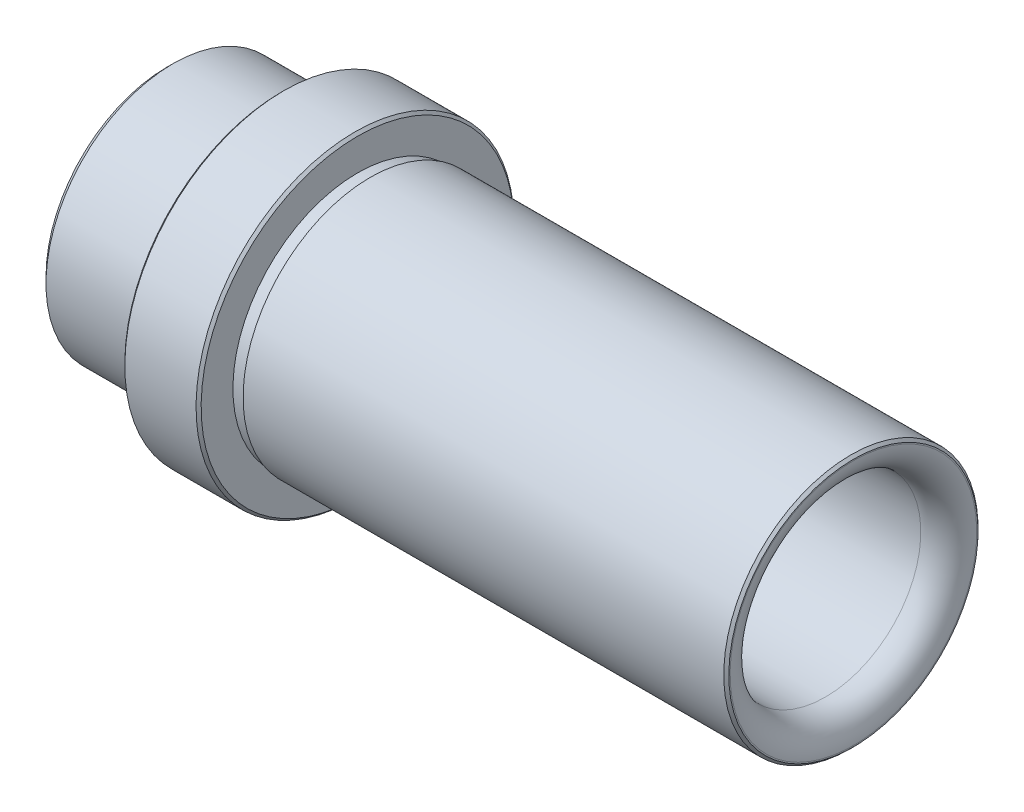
ISO-10303-21;
HEADER;
FILE_DESCRIPTION(('STEP AP214'),'2;1');
FILE_NAME('part.step','',(''),(''),'','','');
FILE_SCHEMA(('AUTOMOTIVE_DESIGN { 1 0 10303 214 1 1 1 1 }'));
ENDSEC;
DATA;
#1=APPLICATION_CONTEXT('core data for automotive mechanical design processes');
#2=APPLICATION_PROTOCOL_DEFINITION('international standard','automotive_design',2000,#1);
#3=PRODUCT_CONTEXT('',#1,'mechanical');
#4=PRODUCT('Part','Part','',(#3));
#5=PRODUCT_RELATED_PRODUCT_CATEGORY('part','',(#4));
#6=PRODUCT_DEFINITION_FORMATION('','',#4);
#7=PRODUCT_DEFINITION_CONTEXT('part definition',#1,'design');
#8=PRODUCT_DEFINITION('design','',#6,#7);
#9=PRODUCT_DEFINITION_SHAPE('','',#8);
#10=(LENGTH_UNIT() NAMED_UNIT(*) SI_UNIT(.MILLI.,.METRE.));
#11=(NAMED_UNIT(*) PLANE_ANGLE_UNIT() SI_UNIT($,.RADIAN.));
#12=(NAMED_UNIT(*) SI_UNIT($,.STERADIAN.) SOLID_ANGLE_UNIT());
#13=UNCERTAINTY_MEASURE_WITH_UNIT(LENGTH_MEASURE(1.E-05),#10,'distance_accuracy_value','');
#14=(GEOMETRIC_REPRESENTATION_CONTEXT(3) GLOBAL_UNCERTAINTY_ASSIGNED_CONTEXT((#13)) GLOBAL_UNIT_ASSIGNED_CONTEXT((#10,
#11,#12)) REPRESENTATION_CONTEXT('',''));
#15=CARTESIAN_POINT('',(0.,0.,0.));
#16=DIRECTION('',(0.,0.,1.));
#17=DIRECTION('',(1.,0.,0.));
#18=AXIS2_PLACEMENT_3D('',#15,#16,#17);
#19=CARTESIAN_POINT('',(-2.89999999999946,-60.0000000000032,-78.0000000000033));
#20=DIRECTION('',(1.,0.,0.));
#21=DIRECTION('',(0.,0.,-1.));
#22=AXIS2_PLACEMENT_3D('',#19,#20,#21);
#23=TOROIDAL_SURFACE('',#22,9.70000000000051,2.2);
#24=CARTESIAN_POINT('',(-0.699999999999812,-60.0000000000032,-78.0000000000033));
#25=DIRECTION('',(1.,0.,0.));
#26=DIRECTION('',(0.,1.00000000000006,0.));
#27=AXIS2_PLACEMENT_3D('',#24,#25,#26);
#28=CIRCLE('',#27,9.7);
#29=CARTESIAN_POINT('',(-0.699999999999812,-50.3000000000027,-78.0000000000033));
#30=VERTEX_POINT('',#29);
#31=EDGE_CURVE('E8',#30,#30,#28,.T.);
#32=ORIENTED_EDGE('',*,*,#31,.T.);
#33=EDGE_LOOP('',(#32));
#34=FACE_BOUND('',#33,.T.);
#35=CARTESIAN_POINT('',(-2.89999999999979,-60.0000000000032,-78.0000000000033));
#36=DIRECTION('',(1.,0.,0.));
#37=DIRECTION('',(0.,1.00000000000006,0.));
#38=AXIS2_PLACEMENT_3D('',#35,#36,#37);
#39=CIRCLE('',#38,7.5);
#40=CARTESIAN_POINT('',(-2.89999999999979,-52.5000000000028,-78.0000000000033));
#41=VERTEX_POINT('',#40);
#42=EDGE_CURVE('E67',#41,#41,#39,.T.);
#43=ORIENTED_EDGE('',*,*,#42,.F.);
#44=EDGE_LOOP('',(#43));
#45=FACE_BOUND('',#44,.T.);
#46=ADVANCED_FACE('F12',(#34,#45),#23,.T.);
#47=CARTESIAN_POINT('',(-0.699999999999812,-50.2500000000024,-78.0000000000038));
#48=DIRECTION('',(1.,0.,0.));
#49=DIRECTION('',(0.,1.00000000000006,0.));
#50=AXIS2_PLACEMENT_3D('',#47,#48,#49);
#51=PLANE('',#50);
#52=CARTESIAN_POINT('',(-0.699999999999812,-60.0000000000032,-78.0000000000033));
#53=DIRECTION('',(1.,0.,0.));
#54=DIRECTION('',(0.,1.00000000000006,0.));
#55=AXIS2_PLACEMENT_3D('',#52,#53,#54);
#56=CIRCLE('',#55,9.8);
#57=CARTESIAN_POINT('',(-0.699999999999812,-50.2000000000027,-78.0000000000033));
#58=VERTEX_POINT('',#57);
#59=EDGE_CURVE('E21',#58,#58,#56,.T.);
#60=ORIENTED_EDGE('',*,*,#59,.T.);
#61=EDGE_LOOP('',(#60));
#62=FACE_BOUND('',#61,.T.);
#63=ORIENTED_EDGE('',*,*,#31,.F.);
#64=EDGE_LOOP('',(#63));
#65=FACE_BOUND('',#64,.T.);
#66=ADVANCED_FACE('F82',(#62,#65),#51,.T.);
#67=DIRECTION('',(0.707106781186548,-0.707106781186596,0.));
#68=VECTOR('',#67,1.);
#69=CARTESIAN_POINT('',(-0.799999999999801,-50.1000000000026,-78.000000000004));
#70=LINE('',#69,#68);
#71=CARTESIAN_POINT('',(9.10000000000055,-60.0000000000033,-78.0000000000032));
#72=DIRECTION('',(-1.,0.,0.));
#73=AXIS1_PLACEMENT('',#71,#72);
#74=SURFACE_OF_REVOLUTION('',#70,#73);
#75=CARTESIAN_POINT('',(-0.89999999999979,-60.0000000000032,-78.0000000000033));
#76=DIRECTION('',(1.,0.,0.));
#77=DIRECTION('',(0.,1.00000000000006,0.));
#78=AXIS2_PLACEMENT_3D('',#75,#76,#77);
#79=CIRCLE('',#78,10.);
#80=CARTESIAN_POINT('',(-0.89999999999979,-50.0000000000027,-78.0000000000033));
#81=VERTEX_POINT('',#80);
#82=EDGE_CURVE('E41',#81,#81,#79,.T.);
#83=ORIENTED_EDGE('',*,*,#82,.T.);
#84=EDGE_LOOP('',(#83));
#85=FACE_BOUND('',#84,.T.);
#86=ORIENTED_EDGE('',*,*,#59,.F.);
#87=EDGE_LOOP('',(#86));
#88=FACE_BOUND('',#87,.T.);
#89=ADVANCED_FACE('F85',(#85,#88),#74,.F.);
#90=CARTESIAN_POINT('',(-19.7999999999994,-60.0000000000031,-78.0000000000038));
#91=DIRECTION('',(-1.,0.,0.));
#92=DIRECTION('',(0.,0.,1.00000000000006));
#93=AXIS2_PLACEMENT_3D('',#90,#91,#92);
#94=CYLINDRICAL_SURFACE('',#93,10.);
#95=CARTESIAN_POINT('',(-38.6999999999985,-60.0000000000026,-78.000000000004));
#96=DIRECTION('',(1.,0.,0.));
#97=DIRECTION('',(0.,1.00000000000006,0.));
#98=AXIS2_PLACEMENT_3D('',#95,#96,#97);
#99=CIRCLE('',#98,10.);
#100=CARTESIAN_POINT('',(-38.6999999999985,-50.000000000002,-78.000000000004));
#101=VERTEX_POINT('',#100);
#102=EDGE_CURVE('E30',#101,#101,#99,.T.);
#103=ORIENTED_EDGE('',*,*,#102,.T.);
#104=EDGE_LOOP('',(#103));
#105=FACE_BOUND('',#104,.T.);
#106=ORIENTED_EDGE('',*,*,#82,.F.);
#107=EDGE_LOOP('',(#106));
#108=FACE_BOUND('',#107,.T.);
#109=ADVANCED_FACE('F89',(#105,#108),#94,.T.);
#110=CARTESIAN_POINT('',(-38.6999999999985,-50.1000000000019,-78.0000000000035));
#111=DIRECTION('',(-1.,0.,0.));
#112=DIRECTION('',(0.,0.,1.00000000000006));
#113=AXIS2_PLACEMENT_3D('',#110,#111,#112);
#114=PLANE('',#113);
#115=CARTESIAN_POINT('',(-38.6999999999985,-60.0000000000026,-78.000000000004));
#116=DIRECTION('',(1.,0.,0.));
#117=DIRECTION('',(0.,1.00000000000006,0.));
#118=AXIS2_PLACEMENT_3D('',#115,#116,#117);
#119=CIRCLE('',#118,9.8);
#120=CARTESIAN_POINT('',(-38.6999999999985,-50.2000000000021,-78.000000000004));
#121=VERTEX_POINT('',#120);
#122=EDGE_CURVE('E49',#121,#121,#119,.T.);
#123=ORIENTED_EDGE('',*,*,#122,.T.);
#124=EDGE_LOOP('',(#123));
#125=FACE_BOUND('',#124,.T.);
#126=ORIENTED_EDGE('',*,*,#102,.F.);
#127=EDGE_LOOP('',(#126));
#128=FACE_BOUND('',#127,.T.);
#129=ADVANCED_FACE('F93',(#125,#128),#114,.T.);
#130=CARTESIAN_POINT('',(-39.1999999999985,-60.0000000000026,-78.000000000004));
#131=DIRECTION('',(-1.,0.,0.));
#132=DIRECTION('',(0.,0.,1.00000000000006));
#133=AXIS2_PLACEMENT_3D('',#130,#131,#132);
#134=CYLINDRICAL_SURFACE('',#133,9.8);
#135=CARTESIAN_POINT('',(-39.6999999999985,-60.0000000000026,-78.000000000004));
#136=DIRECTION('',(1.,0.,0.));
#137=DIRECTION('',(0.,1.00000000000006,0.));
#138=AXIS2_PLACEMENT_3D('',#135,#136,#137);
#139=CIRCLE('',#138,9.8);
#140=CARTESIAN_POINT('',(-39.6999999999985,-50.2000000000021,-78.000000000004));
#141=VERTEX_POINT('',#140);
#142=EDGE_CURVE('E45',#141,#141,#139,.T.);
#143=ORIENTED_EDGE('',*,*,#142,.T.);
#144=EDGE_LOOP('',(#143));
#145=FACE_BOUND('',#144,.T.);
#146=ORIENTED_EDGE('',*,*,#122,.F.);
#147=EDGE_LOOP('',(#146));
#148=FACE_BOUND('',#147,.T.);
#149=ADVANCED_FACE('F97',(#145,#148),#134,.T.);
#150=CARTESIAN_POINT('',(-39.6999999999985,-48.9500000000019,-78.0000000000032));
#151=DIRECTION('',(1.,0.,0.));
#152=DIRECTION('',(0.,0.,-1.00000000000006));
#153=AXIS2_PLACEMENT_3D('',#150,#151,#152);
#154=PLANE('',#153);
#155=CARTESIAN_POINT('',(-39.6999999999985,-60.0000000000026,-78.000000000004));
#156=DIRECTION('',(1.,0.,0.));
#157=DIRECTION('',(0.,1.00000000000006,0.));
#158=AXIS2_PLACEMENT_3D('',#155,#156,#157);
#159=CIRCLE('',#158,12.3);
#160=CARTESIAN_POINT('',(-39.6999999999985,-47.7000000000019,-78.000000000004));
#161=VERTEX_POINT('',#160);
#162=EDGE_CURVE('E34',#161,#161,#159,.T.);
#163=ORIENTED_EDGE('',*,*,#162,.T.);
#164=EDGE_LOOP('',(#163));
#165=FACE_BOUND('',#164,.T.);
#166=ORIENTED_EDGE('',*,*,#142,.F.);
#167=EDGE_LOOP('',(#166));
#168=FACE_BOUND('',#167,.T.);
#169=ADVANCED_FACE('F101',(#165,#168),#154,.T.);
#170=DIRECTION('',(0.707106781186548,-0.707106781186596,0.));
#171=VECTOR('',#170,1.);
#172=CARTESIAN_POINT('',(-39.7999999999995,-47.6000000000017,-78.0000000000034));
#173=LINE('',#172,#171);
#174=CARTESIAN_POINT('',(-27.3999999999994,-60.0000000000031,-78.0000000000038));
#175=DIRECTION('',(-1.,0.,0.));
#176=AXIS1_PLACEMENT('',#174,#175);
#177=SURFACE_OF_REVOLUTION('',#173,#176);
#178=CARTESIAN_POINT('',(-39.8999999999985,-60.0000000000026,-78.000000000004));
#179=DIRECTION('',(1.,0.,0.));
#180=DIRECTION('',(0.,1.00000000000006,0.));
#181=AXIS2_PLACEMENT_3D('',#178,#179,#180);
#182=CIRCLE('',#181,12.5);
#183=CARTESIAN_POINT('',(-39.8999999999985,-47.5000000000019,-78.000000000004));
#184=VERTEX_POINT('',#183);
#185=EDGE_CURVE('E53',#184,#184,#182,.T.);
#186=ORIENTED_EDGE('',*,*,#185,.T.);
#187=EDGE_LOOP('',(#186));
#188=FACE_BOUND('',#187,.T.);
#189=ORIENTED_EDGE('',*,*,#162,.F.);
#190=EDGE_LOOP('',(#189));
#191=FACE_BOUND('',#190,.T.);
#192=ADVANCED_FACE('F105',(#188,#191),#177,.F.);
#193=CARTESIAN_POINT('',(-42.6999999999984,-60.0000000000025,-78.0000000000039));
#194=DIRECTION('',(-1.,0.,0.));
#195=DIRECTION('',(0.,0.,1.00000000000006));
#196=AXIS2_PLACEMENT_3D('',#193,#194,#195);
#197=CYLINDRICAL_SURFACE('',#196,12.5);
#198=CARTESIAN_POINT('',(-45.4999999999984,-60.0000000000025,-78.0000000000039));
#199=DIRECTION('',(1.,0.,0.));
#200=DIRECTION('',(0.,1.00000000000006,0.));
#201=AXIS2_PLACEMENT_3D('',#198,#199,#200);
#202=CIRCLE('',#201,12.5);
#203=CARTESIAN_POINT('',(-45.4999999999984,-47.5000000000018,-78.0000000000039));
#204=VERTEX_POINT('',#203);
#205=EDGE_CURVE('E36',#204,#204,#202,.T.);
#206=ORIENTED_EDGE('',*,*,#205,.T.);
#207=EDGE_LOOP('',(#206));
#208=FACE_BOUND('',#207,.T.);
#209=ORIENTED_EDGE('',*,*,#185,.F.);
#210=EDGE_LOOP('',(#209));
#211=FACE_BOUND('',#210,.T.);
#212=ADVANCED_FACE('F109',(#208,#211),#197,.T.);
#213=DIRECTION('',(-0.707106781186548,-0.707106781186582,0.));
#214=VECTOR('',#213,1.);
#215=CARTESIAN_POINT('',(-45.5999999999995,-47.6000000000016,-78.0000000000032));
#216=LINE('',#215,#214);
#217=CARTESIAN_POINT('',(-57.9999999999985,-60.000000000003,-78.0000000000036));
#218=DIRECTION('',(1.,0.,0.));
#219=AXIS1_PLACEMENT('',#217,#218);
#220=SURFACE_OF_REVOLUTION('',#216,#219);
#221=CARTESIAN_POINT('',(-45.6999999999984,-60.0000000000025,-78.0000000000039));
#222=DIRECTION('',(1.,0.,0.));
#223=DIRECTION('',(0.,1.00000000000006,0.));
#224=AXIS2_PLACEMENT_3D('',#221,#222,#223);
#225=CIRCLE('',#224,12.3);
#226=CARTESIAN_POINT('',(-45.6999999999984,-47.7000000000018,-78.0000000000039));
#227=VERTEX_POINT('',#226);
#228=EDGE_CURVE('E74',#227,#227,#225,.T.);
#229=ORIENTED_EDGE('',*,*,#228,.T.);
#230=EDGE_LOOP('',(#229));
#231=FACE_BOUND('',#230,.T.);
#232=ORIENTED_EDGE('',*,*,#205,.F.);
#233=EDGE_LOOP('',(#232));
#234=FACE_BOUND('',#233,.T.);
#235=ADVANCED_FACE('F116',(#231,#234),#220,.F.);
#236=CARTESIAN_POINT('',(-45.6999999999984,-48.9500000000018,-78.0000000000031));
#237=DIRECTION('',(-1.,0.,0.));
#238=DIRECTION('',(0.,0.,1.00000000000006));
#239=AXIS2_PLACEMENT_3D('',#236,#237,#238);
#240=PLANE('',#239);
#241=CARTESIAN_POINT('',(-45.6999999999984,-60.0000000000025,-78.0000000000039));
#242=DIRECTION('',(1.,0.,0.));
#243=DIRECTION('',(0.,1.00000000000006,0.));
#244=AXIS2_PLACEMENT_3D('',#241,#242,#243);
#245=CIRCLE('',#244,9.8);
#246=CARTESIAN_POINT('',(-45.6999999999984,-50.200000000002,-78.0000000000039));
#247=VERTEX_POINT('',#246);
#248=EDGE_CURVE('E40',#247,#247,#245,.T.);
#249=ORIENTED_EDGE('',*,*,#248,.T.);
#250=EDGE_LOOP('',(#249));
#251=FACE_BOUND('',#250,.T.);
#252=ORIENTED_EDGE('',*,*,#228,.F.);
#253=EDGE_LOOP('',(#252));
#254=FACE_BOUND('',#253,.T.);
#255=ADVANCED_FACE('F119',(#251,#254),#240,.T.);
#256=CARTESIAN_POINT('',(-46.1999999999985,-60.0000000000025,-78.0000000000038));
#257=DIRECTION('',(-1.,0.,0.));
#258=DIRECTION('',(0.,0.,1.00000000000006));
#259=AXIS2_PLACEMENT_3D('',#256,#257,#258);
#260=CYLINDRICAL_SURFACE('',#259,9.8);
#261=CARTESIAN_POINT('',(-46.6999999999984,-60.0000000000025,-78.0000000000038));
#262=DIRECTION('',(1.,0.,0.));
#263=DIRECTION('',(0.,1.00000000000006,0.));
#264=AXIS2_PLACEMENT_3D('',#261,#262,#263);
#265=CIRCLE('',#264,9.8);
#266=CARTESIAN_POINT('',(-46.6999999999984,-50.200000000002,-78.0000000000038));
#267=VERTEX_POINT('',#266);
#268=EDGE_CURVE('E56',#267,#267,#265,.T.);
#269=ORIENTED_EDGE('',*,*,#268,.T.);
#270=EDGE_LOOP('',(#269));
#271=FACE_BOUND('',#270,.T.);
#272=ORIENTED_EDGE('',*,*,#248,.F.);
#273=EDGE_LOOP('',(#272));
#274=FACE_BOUND('',#273,.T.);
#275=ADVANCED_FACE('F123',(#271,#274),#260,.T.);
#276=CARTESIAN_POINT('',(-46.6999999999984,-50.1000000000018,-78.0000000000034));
#277=DIRECTION('',(1.,0.,0.));
#278=DIRECTION('',(0.,0.,-1.00000000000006));
#279=AXIS2_PLACEMENT_3D('',#276,#277,#278);
#280=PLANE('',#279);
#281=CARTESIAN_POINT('',(-46.6999999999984,-60.0000000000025,-78.0000000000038));
#282=DIRECTION('',(1.,0.,0.));
#283=DIRECTION('',(0.,1.00000000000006,0.));
#284=AXIS2_PLACEMENT_3D('',#281,#282,#283);
#285=CIRCLE('',#284,10.);
#286=CARTESIAN_POINT('',(-46.6999999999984,-50.000000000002,-78.0000000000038));
#287=VERTEX_POINT('',#286);
#288=EDGE_CURVE('E164',#287,#287,#285,.T.);
#289=ORIENTED_EDGE('',*,*,#288,.T.);
#290=EDGE_LOOP('',(#289));
#291=FACE_BOUND('',#290,.T.);
#292=ORIENTED_EDGE('',*,*,#268,.F.);
#293=EDGE_LOOP('',(#292));
#294=FACE_BOUND('',#293,.T.);
#295=ADVANCED_FACE('F127',(#291,#294),#280,.T.);
#296=CARTESIAN_POINT('',(-50.4499999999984,-60.0000000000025,-78.0000000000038));
#297=DIRECTION('',(-1.,0.,0.));
#298=DIRECTION('',(0.,0.,1.00000000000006));
#299=AXIS2_PLACEMENT_3D('',#296,#297,#298);
#300=CYLINDRICAL_SURFACE('',#299,10.);
#301=CARTESIAN_POINT('',(-54.1999999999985,-60.0000000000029,-78.0000000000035));
#302=DIRECTION('',(1.,0.,0.));
#303=DIRECTION('',(0.,1.00000000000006,0.));
#304=AXIS2_PLACEMENT_3D('',#301,#302,#303);
#305=CIRCLE('',#304,10.);
#306=CARTESIAN_POINT('',(-54.1999999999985,-50.0000000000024,-78.0000000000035));
#307=VERTEX_POINT('',#306);
#308=EDGE_CURVE('E61',#307,#307,#305,.T.);
#309=ORIENTED_EDGE('',*,*,#308,.T.);
#310=EDGE_LOOP('',(#309));
#311=FACE_BOUND('',#310,.T.);
#312=ORIENTED_EDGE('',*,*,#288,.F.);
#313=EDGE_LOOP('',(#312));
#314=FACE_BOUND('',#313,.T.);
#315=ADVANCED_FACE('F131',(#311,#314),#300,.T.);
#316=DIRECTION('',(-0.707106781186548,-0.707106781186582,0.));
#317=VECTOR('',#316,1.);
#318=CARTESIAN_POINT('',(-54.4499999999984,-50.2500000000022,-78.0000000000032));
#319=LINE('',#318,#317);
#320=CARTESIAN_POINT('',(-64.2,-60.000000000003,-78.0000000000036));
#321=DIRECTION('',(1.,0.,0.));
#322=AXIS1_PLACEMENT('',#320,#321);
#323=SURFACE_OF_REVOLUTION('',#319,#322);
#324=CARTESIAN_POINT('',(-54.6999999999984,-60.0000000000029,-78.0000000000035));
#325=DIRECTION('',(1.,0.,0.));
#326=DIRECTION('',(0.,1.00000000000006,0.));
#327=AXIS2_PLACEMENT_3D('',#324,#325,#326);
#328=CIRCLE('',#327,9.5);
#329=CARTESIAN_POINT('',(-54.6999999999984,-50.5000000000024,-78.0000000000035));
#330=VERTEX_POINT('',#329);
#331=EDGE_CURVE('E57',#330,#330,#328,.T.);
#332=ORIENTED_EDGE('',*,*,#331,.T.);
#333=EDGE_LOOP('',(#332));
#334=FACE_BOUND('',#333,.T.);
#335=ORIENTED_EDGE('',*,*,#308,.F.);
#336=EDGE_LOOP('',(#335));
#337=FACE_BOUND('',#336,.T.);
#338=ADVANCED_FACE('F135',(#334,#337),#323,.F.);
#339=CARTESIAN_POINT('',(-54.6999999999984,-51.2500000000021,-78.0000000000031));
#340=DIRECTION('',(-1.,0.,0.));
#341=DIRECTION('',(0.,0.,1.00000000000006));
#342=AXIS2_PLACEMENT_3D('',#339,#340,#341);
#343=PLANE('',#342);
#344=CARTESIAN_POINT('',(-54.6999999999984,-60.0000000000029,-78.0000000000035));
#345=DIRECTION('',(1.,0.,0.));
#346=DIRECTION('',(0.,1.00000000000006,0.));
#347=AXIS2_PLACEMENT_3D('',#344,#345,#346);
#348=CIRCLE('',#347,8.);
#349=CARTESIAN_POINT('',(-54.6999999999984,-52.0000000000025,-78.0000000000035));
#350=VERTEX_POINT('',#349);
#351=EDGE_CURVE('E62',#350,#350,#348,.T.);
#352=ORIENTED_EDGE('',*,*,#351,.T.);
#353=EDGE_LOOP('',(#352));
#354=FACE_BOUND('',#353,.T.);
#355=ORIENTED_EDGE('',*,*,#331,.F.);
#356=EDGE_LOOP('',(#355));
#357=FACE_BOUND('',#356,.T.);
#358=ADVANCED_FACE('F139',(#354,#357),#343,.T.);
#359=DIRECTION('',(-0.707106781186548,0.707106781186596,0.));
#360=VECTOR('',#359,1.);
#361=CARTESIAN_POINT('',(-54.4499999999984,-52.2500000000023,-78.0000000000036));
#362=LINE('',#361,#360);
#363=CARTESIAN_POINT('',(-46.6999999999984,-60.0000000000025,-78.0000000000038));
#364=DIRECTION('',(-1.,0.,0.));
#365=AXIS1_PLACEMENT('',#363,#364);
#366=SURFACE_OF_REVOLUTION('',#362,#365);
#367=ORIENTED_EDGE('',*,*,#351,.F.);
#368=EDGE_LOOP('',(#367));
#369=FACE_BOUND('',#368,.T.);
#370=CARTESIAN_POINT('',(-54.1999999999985,-60.0000000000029,-78.0000000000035));
#371=DIRECTION('',(1.,0.,0.));
#372=DIRECTION('',(0.,1.00000000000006,0.));
#373=AXIS2_PLACEMENT_3D('',#370,#371,#372);
#374=CIRCLE('',#373,7.5);
#375=CARTESIAN_POINT('',(-54.1999999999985,-52.5000000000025,-78.0000000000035));
#376=VERTEX_POINT('',#375);
#377=EDGE_CURVE('E63',#376,#376,#374,.T.);
#378=ORIENTED_EDGE('',*,*,#377,.T.);
#379=EDGE_LOOP('',(#378));
#380=FACE_BOUND('',#379,.T.);
#381=ADVANCED_FACE('F142',(#369,#380),#366,.F.);
#382=CARTESIAN_POINT('',(-28.5499999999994,-60.000000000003,-78.0000000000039));
#383=DIRECTION('',(-1.,0.,0.));
#384=DIRECTION('',(0.,0.,1.00000000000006));
#385=AXIS2_PLACEMENT_3D('',#382,#383,#384);
#386=CYLINDRICAL_SURFACE('',#385,7.5);
#387=ORIENTED_EDGE('',*,*,#377,.F.);
#388=EDGE_LOOP('',(#387));
#389=FACE_BOUND('',#388,.T.);
#390=ORIENTED_EDGE('',*,*,#42,.T.);
#391=EDGE_LOOP('',(#390));
#392=FACE_BOUND('',#391,.T.);
#393=ADVANCED_FACE('F14',(#389,#392),#386,.F.);
#394=CLOSED_SHELL('',(#46,#66,#89,#109,#129,#149,#169,#192,#212,#235,#255,#275,#295,#315,#338,
#358,#381,#393));
#395=MANIFOLD_SOLID_BREP('B1',#394);
#396=ADVANCED_BREP_SHAPE_REPRESENTATION('',(#18,#395),#14);
#397=SHAPE_DEFINITION_REPRESENTATION(#9,#396);
ENDSEC;
END-ISO-10303-21;
